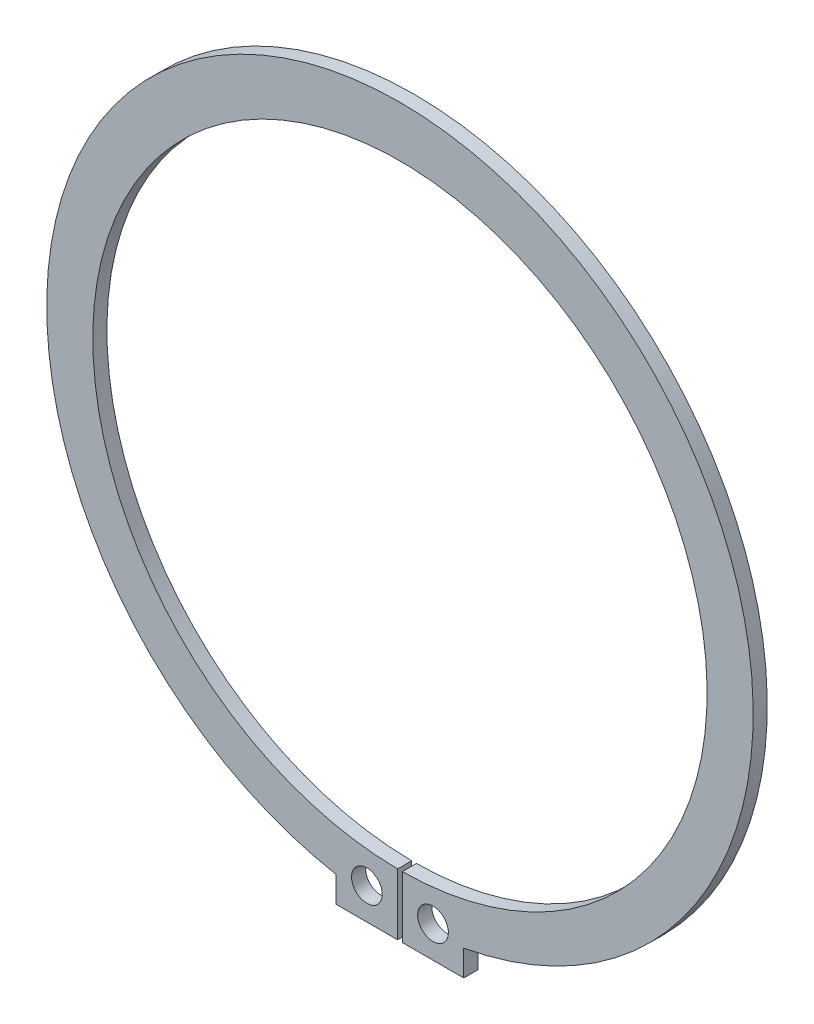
ISO-10303-21;
HEADER;
FILE_DESCRIPTION(('STEP AP214'),'2;1');
FILE_NAME('part.step','',(''),(''),'','','');
FILE_SCHEMA(('AUTOMOTIVE_DESIGN { 1 0 10303 214 1 1 1 1 }'));
ENDSEC;
DATA;
#1=APPLICATION_CONTEXT('core data for automotive mechanical design processes');
#2=APPLICATION_PROTOCOL_DEFINITION('international standard','automotive_design',2000,#1);
#3=PRODUCT_CONTEXT('',#1,'mechanical');
#4=PRODUCT('Part','Part','',(#3));
#5=PRODUCT_RELATED_PRODUCT_CATEGORY('part','',(#4));
#6=PRODUCT_DEFINITION_FORMATION('','',#4);
#7=PRODUCT_DEFINITION_CONTEXT('part definition',#1,'design');
#8=PRODUCT_DEFINITION('design','',#6,#7);
#9=PRODUCT_DEFINITION_SHAPE('','',#8);
#10=(LENGTH_UNIT() NAMED_UNIT(*) SI_UNIT(.MILLI.,.METRE.));
#11=(NAMED_UNIT(*) PLANE_ANGLE_UNIT() SI_UNIT($,.RADIAN.));
#12=(NAMED_UNIT(*) SI_UNIT($,.STERADIAN.) SOLID_ANGLE_UNIT());
#13=UNCERTAINTY_MEASURE_WITH_UNIT(LENGTH_MEASURE(1.E-05),#10,'distance_accuracy_value','');
#14=(GEOMETRIC_REPRESENTATION_CONTEXT(3) GLOBAL_UNCERTAINTY_ASSIGNED_CONTEXT((#13)) GLOBAL_UNIT_ASSIGNED_CONTEXT((#10,
#11,#12)) REPRESENTATION_CONTEXT('',''));
#15=CARTESIAN_POINT('',(0.,0.,0.));
#16=DIRECTION('',(0.,0.,1.));
#17=DIRECTION('',(1.,0.,0.));
#18=AXIS2_PLACEMENT_3D('',#15,#16,#17);
#19=CARTESIAN_POINT('',(0.,0.,1.12));
#20=DIRECTION('',(0.,0.,1.));
#21=DIRECTION('',(1.,0.,0.));
#22=AXIS2_PLACEMENT_3D('',#19,#20,#21);
#23=PLANE('',#22);
#24=DIRECTION('',(0.,-1.,0.));
#25=VECTOR('',#24,1.);
#26=CARTESIAN_POINT('',(-0.186666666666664,-24.7726192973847,1.12));
#27=LINE('',#26,#25);
#28=CARTESIAN_POINT('',(-0.186666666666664,-24.7726192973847,1.12));
#29=VERTEX_POINT('',#28);
#30=CARTESIAN_POINT('',(-0.186666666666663,-29.6526192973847,1.12));
#31=VERTEX_POINT('',#30);
#32=EDGE_CURVE('E104',#29,#31,#27,.T.);
#33=ORIENTED_EDGE('',*,*,#32,.F.);
#34=CARTESIAN_POINT('',(0.,-0.373333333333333,1.12));
#35=DIRECTION('',(0.,0.,1.));
#36=DIRECTION('',(1.,0.,0.));
#37=AXIS2_PLACEMENT_3D('',#34,#35,#36);
#38=CIRCLE('',#37,24.4);
#39=CARTESIAN_POINT('',(0.18666666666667,-24.7726192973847,1.12));
#40=VERTEX_POINT('',#39);
#41=EDGE_CURVE('E155',#40,#29,#38,.T.);
#42=ORIENTED_EDGE('',*,*,#41,.F.);
#43=DIRECTION('',(0.,-1.,0.));
#44=VECTOR('',#43,1.);
#45=CARTESIAN_POINT('',(0.18666666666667,-24.7726192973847,1.12));
#46=LINE('',#45,#44);
#47=CARTESIAN_POINT('',(0.18666666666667,-29.6526192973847,1.12));
#48=VERTEX_POINT('',#47);
#49=EDGE_CURVE('E53',#40,#48,#46,.T.);
#50=ORIENTED_EDGE('',*,*,#49,.T.);
#51=DIRECTION('',(1.,0.,0.));
#52=VECTOR('',#51,1.);
#53=CARTESIAN_POINT('',(0.18666666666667,-29.6526192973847,1.12));
#54=LINE('',#53,#52);
#55=CARTESIAN_POINT('',(5.06666666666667,-29.6526192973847,1.12));
#56=VERTEX_POINT('',#55);
#57=EDGE_CURVE('E110',#48,#56,#54,.T.);
#58=ORIENTED_EDGE('',*,*,#57,.T.);
#59=DIRECTION('',(0.,1.,0.));
#60=VECTOR('',#59,1.);
#61=CARTESIAN_POINT('',(5.06666666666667,-29.6526192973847,1.12));
#62=LINE('',#61,#60);
#63=CARTESIAN_POINT('',(5.06666666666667,-27.5987769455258,1.12));
#64=VERTEX_POINT('',#63);
#65=EDGE_CURVE('E45',#56,#64,#62,.T.);
#66=ORIENTED_EDGE('',*,*,#65,.T.);
#67=CARTESIAN_POINT('',(0.,0.,1.12));
#68=DIRECTION('',(0.,0.,1.));
#69=DIRECTION('',(1.,0.,0.));
#70=AXIS2_PLACEMENT_3D('',#67,#68,#69);
#71=CIRCLE('',#70,28.06);
#72=CARTESIAN_POINT('',(-5.06666666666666,-27.5987769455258,1.12));
#73=VERTEX_POINT('',#72);
#74=EDGE_CURVE('E11',#64,#73,#71,.T.);
#75=ORIENTED_EDGE('',*,*,#74,.T.);
#76=DIRECTION('',(0.,1.,0.));
#77=VECTOR('',#76,1.);
#78=CARTESIAN_POINT('',(-5.06666666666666,-29.6526192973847,1.12));
#79=LINE('',#78,#77);
#80=CARTESIAN_POINT('',(-5.06666666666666,-29.6526192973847,1.12));
#81=VERTEX_POINT('',#80);
#82=EDGE_CURVE('E129',#81,#73,#79,.T.);
#83=ORIENTED_EDGE('',*,*,#82,.F.);
#84=DIRECTION('',(-1.,0.,0.));
#85=VECTOR('',#84,1.);
#86=CARTESIAN_POINT('',(-0.186666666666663,-29.6526192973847,1.12));
#87=LINE('',#86,#85);
#88=EDGE_CURVE('E134',#31,#81,#87,.T.);
#89=ORIENTED_EDGE('',*,*,#88,.F.);
#90=EDGE_LOOP('',(#33,#42,#50,#58,#66,#75,#83,#89));
#91=FACE_BOUND('',#90,.T.);
#92=CARTESIAN_POINT('',(-2.62666666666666,-27.142079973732,1.12));
#93=DIRECTION('',(0.,0.,1.));
#94=DIRECTION('',(1.,0.,0.));
#95=AXIS2_PLACEMENT_3D('',#92,#93,#94);
#96=CIRCLE('',#95,1.22);
#97=CARTESIAN_POINT('',(-1.40666666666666,-27.142079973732,1.12));
#98=VERTEX_POINT('',#97);
#99=EDGE_CURVE('E269',#98,#98,#96,.T.);
#100=ORIENTED_EDGE('',*,*,#99,.F.);
#101=EDGE_LOOP('',(#100));
#102=FACE_BOUND('',#101,.T.);
#103=CARTESIAN_POINT('',(2.62666666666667,-27.142079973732,1.12));
#104=DIRECTION('',(0.,0.,-1.));
#105=DIRECTION('',(-1.,0.,0.));
#106=AXIS2_PLACEMENT_3D('',#103,#104,#105);
#107=CIRCLE('',#106,1.22);
#108=CARTESIAN_POINT('',(1.40666666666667,-27.142079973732,1.12));
#109=VERTEX_POINT('',#108);
#110=EDGE_CURVE('E266',#109,#109,#107,.T.);
#111=ORIENTED_EDGE('',*,*,#110,.T.);
#112=EDGE_LOOP('',(#111));
#113=FACE_BOUND('',#112,.T.);
#114=ADVANCED_FACE('F31',(#91,#102,#113),#23,.T.);
#115=CARTESIAN_POINT('',(0.,0.,0.));
#116=DIRECTION('',(0.,0.,1.));
#117=DIRECTION('',(1.,0.,0.));
#118=AXIS2_PLACEMENT_3D('',#115,#116,#117);
#119=PLANE('',#118);
#120=CARTESIAN_POINT('',(0.,0.,0.));
#121=DIRECTION('',(0.,0.,1.));
#122=DIRECTION('',(1.,0.,0.));
#123=AXIS2_PLACEMENT_3D('',#120,#121,#122);
#124=CIRCLE('',#123,28.06);
#125=CARTESIAN_POINT('',(5.06666666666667,-27.5987769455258,0.));
#126=VERTEX_POINT('',#125);
#127=CARTESIAN_POINT('',(-5.06666666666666,-27.5987769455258,0.));
#128=VERTEX_POINT('',#127);
#129=EDGE_CURVE('E35',#126,#128,#124,.T.);
#130=ORIENTED_EDGE('',*,*,#129,.F.);
#131=DIRECTION('',(0.,1.,0.));
#132=VECTOR('',#131,1.);
#133=CARTESIAN_POINT('',(5.06666666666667,-29.6526192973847,0.));
#134=LINE('',#133,#132);
#135=CARTESIAN_POINT('',(5.06666666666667,-29.6526192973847,0.));
#136=VERTEX_POINT('',#135);
#137=EDGE_CURVE('E117',#136,#126,#134,.T.);
#138=ORIENTED_EDGE('',*,*,#137,.F.);
#139=DIRECTION('',(1.,0.,0.));
#140=VECTOR('',#139,1.);
#141=CARTESIAN_POINT('',(0.18666666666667,-29.6526192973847,0.));
#142=LINE('',#141,#140);
#143=CARTESIAN_POINT('',(0.18666666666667,-29.6526192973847,0.));
#144=VERTEX_POINT('',#143);
#145=EDGE_CURVE('E109',#144,#136,#142,.T.);
#146=ORIENTED_EDGE('',*,*,#145,.F.);
#147=DIRECTION('',(0.,-1.,0.));
#148=VECTOR('',#147,1.);
#149=CARTESIAN_POINT('',(0.18666666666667,-24.7726192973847,0.));
#150=LINE('',#149,#148);
#151=CARTESIAN_POINT('',(0.18666666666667,-24.7726192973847,0.));
#152=VERTEX_POINT('',#151);
#153=EDGE_CURVE('E94',#152,#144,#150,.T.);
#154=ORIENTED_EDGE('',*,*,#153,.F.);
#155=CARTESIAN_POINT('',(0.,-0.373333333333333,0.));
#156=DIRECTION('',(0.,0.,1.));
#157=DIRECTION('',(1.,0.,0.));
#158=AXIS2_PLACEMENT_3D('',#155,#156,#157);
#159=CIRCLE('',#158,24.4);
#160=CARTESIAN_POINT('',(-0.186666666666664,-24.7726192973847,0.));
#161=VERTEX_POINT('',#160);
#162=EDGE_CURVE('E156',#152,#161,#159,.T.);
#163=ORIENTED_EDGE('',*,*,#162,.T.);
#164=DIRECTION('',(0.,-1.,0.));
#165=VECTOR('',#164,1.);
#166=CARTESIAN_POINT('',(-0.186666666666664,-24.7726192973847,0.));
#167=LINE('',#166,#165);
#168=CARTESIAN_POINT('',(-0.186666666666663,-29.6526192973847,0.));
#169=VERTEX_POINT('',#168);
#170=EDGE_CURVE('E103',#161,#169,#167,.T.);
#171=ORIENTED_EDGE('',*,*,#170,.T.);
#172=DIRECTION('',(-1.,0.,0.));
#173=VECTOR('',#172,1.);
#174=CARTESIAN_POINT('',(-0.186666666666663,-29.6526192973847,0.));
#175=LINE('',#174,#173);
#176=CARTESIAN_POINT('',(-5.06666666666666,-29.6526192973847,0.));
#177=VERTEX_POINT('',#176);
#178=EDGE_CURVE('E133',#169,#177,#175,.T.);
#179=ORIENTED_EDGE('',*,*,#178,.T.);
#180=DIRECTION('',(0.,1.,0.));
#181=VECTOR('',#180,1.);
#182=CARTESIAN_POINT('',(-5.06666666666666,-29.6526192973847,0.));
#183=LINE('',#182,#181);
#184=EDGE_CURVE('E130',#177,#128,#183,.T.);
#185=ORIENTED_EDGE('',*,*,#184,.T.);
#186=EDGE_LOOP('',(#130,#138,#146,#154,#163,#171,#179,#185));
#187=FACE_BOUND('',#186,.T.);
#188=CARTESIAN_POINT('',(-2.62666666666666,-27.142079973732,0.));
#189=DIRECTION('',(0.,0.,1.));
#190=DIRECTION('',(1.,0.,0.));
#191=AXIS2_PLACEMENT_3D('',#188,#189,#190);
#192=CIRCLE('',#191,1.22);
#193=CARTESIAN_POINT('',(-1.40666666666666,-27.142079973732,0.));
#194=VERTEX_POINT('',#193);
#195=EDGE_CURVE('E123',#194,#194,#192,.T.);
#196=ORIENTED_EDGE('',*,*,#195,.T.);
#197=EDGE_LOOP('',(#196));
#198=FACE_BOUND('',#197,.T.);
#199=CARTESIAN_POINT('',(2.62666666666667,-27.142079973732,0.));
#200=DIRECTION('',(0.,0.,-1.));
#201=DIRECTION('',(-1.,0.,0.));
#202=AXIS2_PLACEMENT_3D('',#199,#200,#201);
#203=CIRCLE('',#202,1.22);
#204=CARTESIAN_POINT('',(1.40666666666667,-27.142079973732,0.));
#205=VERTEX_POINT('',#204);
#206=EDGE_CURVE('E263',#205,#205,#203,.T.);
#207=ORIENTED_EDGE('',*,*,#206,.F.);
#208=EDGE_LOOP('',(#207));
#209=FACE_BOUND('',#208,.T.);
#210=ADVANCED_FACE('F115',(#187,#198,#209),#119,.F.);
#211=CARTESIAN_POINT('',(0.,0.,1.12));
#212=DIRECTION('',(0.,0.,-1.));
#213=DIRECTION('',(-1.,0.,0.));
#214=AXIS2_PLACEMENT_3D('',#211,#212,#213);
#215=CYLINDRICAL_SURFACE('',#214,28.06);
#216=ORIENTED_EDGE('',*,*,#74,.F.);
#217=DIRECTION('',(0.,0.,-1.));
#218=VECTOR('',#217,1.);
#219=CARTESIAN_POINT('',(5.06666666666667,-27.5987769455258,1.12));
#220=LINE('',#219,#218);
#221=EDGE_CURVE('E125',#64,#126,#220,.T.);
#222=ORIENTED_EDGE('',*,*,#221,.T.);
#223=ORIENTED_EDGE('',*,*,#129,.T.);
#224=DIRECTION('',(0.,0.,-1.));
#225=VECTOR('',#224,1.);
#226=CARTESIAN_POINT('',(-5.06666666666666,-27.5987769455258,1.12));
#227=LINE('',#226,#225);
#228=EDGE_CURVE('E143',#73,#128,#227,.T.);
#229=ORIENTED_EDGE('',*,*,#228,.F.);
#230=EDGE_LOOP('',(#216,#222,#223,#229));
#231=FACE_BOUND('',#230,.T.);
#232=ADVANCED_FACE('F33',(#231),#215,.T.);
#233=CARTESIAN_POINT('',(0.,-0.373333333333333,0.));
#234=DIRECTION('',(0.,0.,1.));
#235=DIRECTION('',(1.,0.,0.));
#236=AXIS2_PLACEMENT_3D('',#233,#234,#235);
#237=CYLINDRICAL_SURFACE('',#236,24.4);
#238=DIRECTION('',(0.,0.,1.));
#239=VECTOR('',#238,1.);
#240=CARTESIAN_POINT('',(-0.186666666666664,-24.7726192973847,0.));
#241=LINE('',#240,#239);
#242=EDGE_CURVE('E149',#161,#29,#241,.T.);
#243=ORIENTED_EDGE('',*,*,#242,.F.);
#244=ORIENTED_EDGE('',*,*,#162,.F.);
#245=DIRECTION('',(0.,0.,1.));
#246=VECTOR('',#245,1.);
#247=CARTESIAN_POINT('',(0.18666666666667,-24.7726192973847,0.));
#248=LINE('',#247,#246);
#249=EDGE_CURVE('E99',#152,#40,#248,.T.);
#250=ORIENTED_EDGE('',*,*,#249,.T.);
#251=ORIENTED_EDGE('',*,*,#41,.T.);
#252=EDGE_LOOP('',(#243,#244,#250,#251));
#253=FACE_BOUND('',#252,.T.);
#254=ADVANCED_FACE('F161',(#253),#237,.F.);
#255=CARTESIAN_POINT('',(-0.186666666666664,-24.7726192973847,0.));
#256=DIRECTION('',(-1.,0.,0.));
#257=DIRECTION('',(0.,-1.,0.));
#258=AXIS2_PLACEMENT_3D('',#255,#256,#257);
#259=PLANE('',#258);
#260=ORIENTED_EDGE('',*,*,#32,.T.);
#261=DIRECTION('',(0.,0.,1.));
#262=VECTOR('',#261,1.);
#263=CARTESIAN_POINT('',(-0.186666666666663,-29.6526192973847,0.));
#264=LINE('',#263,#262);
#265=EDGE_CURVE('E140',#169,#31,#264,.T.);
#266=ORIENTED_EDGE('',*,*,#265,.F.);
#267=ORIENTED_EDGE('',*,*,#170,.F.);
#268=ORIENTED_EDGE('',*,*,#242,.T.);
#269=EDGE_LOOP('',(#260,#266,#267,#268));
#270=FACE_BOUND('',#269,.T.);
#271=ADVANCED_FACE('F165',(#270),#259,.F.);
#272=CARTESIAN_POINT('',(0.18666666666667,-24.7726192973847,0.));
#273=DIRECTION('',(-1.,0.,0.));
#274=DIRECTION('',(0.,-1.,0.));
#275=AXIS2_PLACEMENT_3D('',#272,#273,#274);
#276=PLANE('',#275);
#277=ORIENTED_EDGE('',*,*,#49,.F.);
#278=ORIENTED_EDGE('',*,*,#249,.F.);
#279=ORIENTED_EDGE('',*,*,#153,.T.);
#280=DIRECTION('',(0.,0.,1.));
#281=VECTOR('',#280,1.);
#282=CARTESIAN_POINT('',(0.18666666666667,-29.6526192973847,0.));
#283=LINE('',#282,#281);
#284=EDGE_CURVE('E97',#144,#48,#283,.T.);
#285=ORIENTED_EDGE('',*,*,#284,.T.);
#286=EDGE_LOOP('',(#277,#278,#279,#285));
#287=FACE_BOUND('',#286,.T.);
#288=ADVANCED_FACE('F96',(#287),#276,.T.);
#289=CARTESIAN_POINT('',(-5.06666666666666,-29.6526192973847,0.));
#290=DIRECTION('',(1.,0.,0.));
#291=DIRECTION('',(0.,1.,0.));
#292=AXIS2_PLACEMENT_3D('',#289,#290,#291);
#293=PLANE('',#292);
#294=ORIENTED_EDGE('',*,*,#82,.T.);
#295=ORIENTED_EDGE('',*,*,#228,.T.);
#296=ORIENTED_EDGE('',*,*,#184,.F.);
#297=DIRECTION('',(0.,0.,1.));
#298=VECTOR('',#297,1.);
#299=CARTESIAN_POINT('',(-5.06666666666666,-29.6526192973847,0.));
#300=LINE('',#299,#298);
#301=EDGE_CURVE('E136',#177,#81,#300,.T.);
#302=ORIENTED_EDGE('',*,*,#301,.T.);
#303=EDGE_LOOP('',(#294,#295,#296,#302));
#304=FACE_BOUND('',#303,.T.);
#305=ADVANCED_FACE('F176',(#304),#293,.F.);
#306=CARTESIAN_POINT('',(-0.186666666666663,-29.6526192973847,0.));
#307=DIRECTION('',(0.,1.,0.));
#308=DIRECTION('',(0.,0.,1.));
#309=AXIS2_PLACEMENT_3D('',#306,#307,#308);
#310=PLANE('',#309);
#311=ORIENTED_EDGE('',*,*,#88,.T.);
#312=ORIENTED_EDGE('',*,*,#301,.F.);
#313=ORIENTED_EDGE('',*,*,#178,.F.);
#314=ORIENTED_EDGE('',*,*,#265,.T.);
#315=EDGE_LOOP('',(#311,#312,#313,#314));
#316=FACE_BOUND('',#315,.T.);
#317=ADVANCED_FACE('F172',(#316),#310,.F.);
#318=CARTESIAN_POINT('',(5.06666666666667,-29.6526192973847,0.));
#319=DIRECTION('',(1.,0.,0.));
#320=DIRECTION('',(0.,1.,0.));
#321=AXIS2_PLACEMENT_3D('',#318,#319,#320);
#322=PLANE('',#321);
#323=ORIENTED_EDGE('',*,*,#221,.F.);
#324=ORIENTED_EDGE('',*,*,#65,.F.);
#325=DIRECTION('',(0.,0.,1.));
#326=VECTOR('',#325,1.);
#327=CARTESIAN_POINT('',(5.06666666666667,-29.6526192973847,0.));
#328=LINE('',#327,#326);
#329=EDGE_CURVE('E111',#136,#56,#328,.T.);
#330=ORIENTED_EDGE('',*,*,#329,.F.);
#331=ORIENTED_EDGE('',*,*,#137,.T.);
#332=EDGE_LOOP('',(#323,#324,#330,#331));
#333=FACE_BOUND('',#332,.T.);
#334=ADVANCED_FACE('F181',(#333),#322,.T.);
#335=CARTESIAN_POINT('',(0.18666666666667,-29.6526192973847,0.));
#336=DIRECTION('',(0.,-1.,0.));
#337=DIRECTION('',(0.,0.,-1.));
#338=AXIS2_PLACEMENT_3D('',#335,#336,#337);
#339=PLANE('',#338);
#340=ORIENTED_EDGE('',*,*,#57,.F.);
#341=ORIENTED_EDGE('',*,*,#284,.F.);
#342=ORIENTED_EDGE('',*,*,#145,.T.);
#343=ORIENTED_EDGE('',*,*,#329,.T.);
#344=EDGE_LOOP('',(#340,#341,#342,#343));
#345=FACE_BOUND('',#344,.T.);
#346=ADVANCED_FACE('F108',(#345),#339,.T.);
#347=CARTESIAN_POINT('',(-2.62666666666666,-27.142079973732,0.));
#348=DIRECTION('',(0.,0.,1.));
#349=DIRECTION('',(1.,0.,0.));
#350=AXIS2_PLACEMENT_3D('',#347,#348,#349);
#351=CYLINDRICAL_SURFACE('',#350,1.22);
#352=ORIENTED_EDGE('',*,*,#195,.F.);
#353=EDGE_LOOP('',(#352));
#354=FACE_BOUND('',#353,.T.);
#355=ORIENTED_EDGE('',*,*,#99,.T.);
#356=EDGE_LOOP('',(#355));
#357=FACE_BOUND('',#356,.T.);
#358=ADVANCED_FACE('F188',(#354,#357),#351,.F.);
#359=CARTESIAN_POINT('',(2.62666666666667,-27.142079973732,0.));
#360=DIRECTION('',(0.,0.,1.));
#361=DIRECTION('',(1.,0.,0.));
#362=AXIS2_PLACEMENT_3D('',#359,#360,#361);
#363=CYLINDRICAL_SURFACE('',#362,1.22);
#364=ORIENTED_EDGE('',*,*,#206,.T.);
#365=EDGE_LOOP('',(#364));
#366=FACE_BOUND('',#365,.T.);
#367=ORIENTED_EDGE('',*,*,#110,.F.);
#368=EDGE_LOOP('',(#367));
#369=FACE_BOUND('',#368,.T.);
#370=ADVANCED_FACE('F246',(#366,#369),#363,.F.);
#371=CLOSED_SHELL('',(#114,#210,#232,#254,#271,#288,#305,#317,#334,#346,#358,#370));
#372=MANIFOLD_SOLID_BREP('B2',#371);
#373=ADVANCED_BREP_SHAPE_REPRESENTATION('',(#18,#372),#14);
#374=SHAPE_DEFINITION_REPRESENTATION(#9,#373);
ENDSEC;
END-ISO-10303-21;
